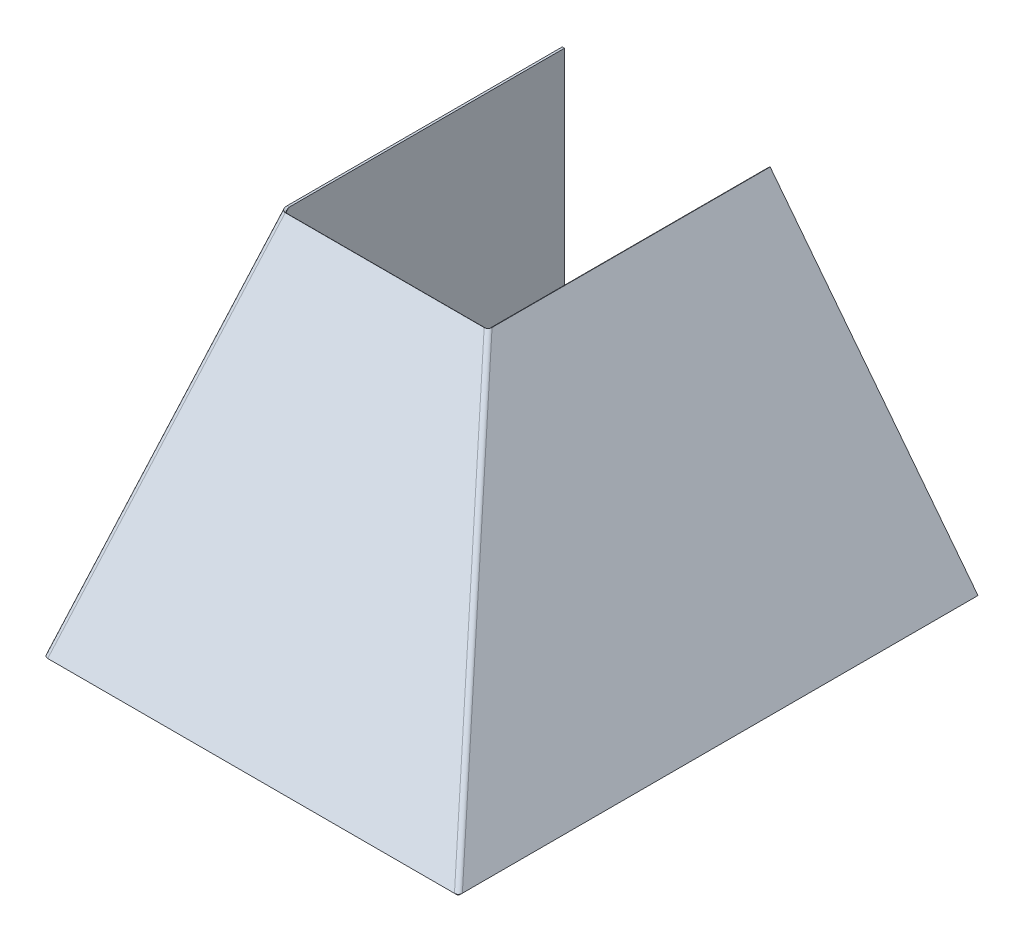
ISO-10303-21;
HEADER;
FILE_DESCRIPTION(('STEP AP214'),'2;1');
FILE_NAME('part.step','',(''),(''),'','','');
FILE_SCHEMA(('AUTOMOTIVE_DESIGN { 1 0 10303 214 1 1 1 1 }'));
ENDSEC;
DATA;
#1=APPLICATION_CONTEXT('core data for automotive mechanical design processes');
#2=APPLICATION_PROTOCOL_DEFINITION('international standard','automotive_design',2000,#1);
#3=PRODUCT_CONTEXT('',#1,'mechanical');
#4=PRODUCT('Part','Part','',(#3));
#5=PRODUCT_RELATED_PRODUCT_CATEGORY('part','',(#4));
#6=PRODUCT_DEFINITION_FORMATION('','',#4);
#7=PRODUCT_DEFINITION_CONTEXT('part definition',#1,'design');
#8=PRODUCT_DEFINITION('design','',#6,#7);
#9=PRODUCT_DEFINITION_SHAPE('','',#8);
#10=(LENGTH_UNIT() NAMED_UNIT(*) SI_UNIT(.MILLI.,.METRE.));
#11=(NAMED_UNIT(*) PLANE_ANGLE_UNIT() SI_UNIT($,.RADIAN.));
#12=(NAMED_UNIT(*) SI_UNIT($,.STERADIAN.) SOLID_ANGLE_UNIT());
#13=UNCERTAINTY_MEASURE_WITH_UNIT(LENGTH_MEASURE(1.E-05),#10,'distance_accuracy_value','');
#14=(GEOMETRIC_REPRESENTATION_CONTEXT(3) GLOBAL_UNCERTAINTY_ASSIGNED_CONTEXT((#13)) GLOBAL_UNIT_ASSIGNED_CONTEXT((#10,
#11,#12)) REPRESENTATION_CONTEXT('',''));
#15=CARTESIAN_POINT('',(0.,0.,0.));
#16=DIRECTION('',(0.,0.,1.));
#17=DIRECTION('',(1.,0.,0.));
#18=AXIS2_PLACEMENT_3D('',#15,#16,#17);
#19=CARTESIAN_POINT('',(0.,0.,0.));
#20=DIRECTION('',(0.,0.74740931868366,-0.66436383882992));
#21=DIRECTION('',(1.,0.,0.));
#22=AXIS2_PLACEMENT_3D('',#19,#20,#21);
#23=PLANE('',#22);
#24=DIRECTION('',(0.,0.66436383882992,0.74740931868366));
#25=VECTOR('',#24,1.);
#26=CARTESIAN_POINT('',(3.45000000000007,0.,0.));
#27=LINE('',#26,#25);
#28=CARTESIAN_POINT('',(3.45000000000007,-0.99654575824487,-1.12111397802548));
#29=VERTEX_POINT('',#28);
#30=CARTESIAN_POINT('',(3.45000000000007,0.,0.));
#31=VERTEX_POINT('',#30);
#32=EDGE_CURVE('E13',#29,#31,#27,.T.);
#33=ORIENTED_EDGE('',*,*,#32,.F.);
#34=DIRECTION('',(1.,0.,0.));
#35=VECTOR('',#34,1.);
#36=CARTESIAN_POINT('',(0.,-0.99654575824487,-1.12111397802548));
#37=LINE('',#36,#35);
#38=CARTESIAN_POINT('',(277.412037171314,-0.99654575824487,-1.12111397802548));
#39=VERTEX_POINT('',#38);
#40=EDGE_CURVE('E103',#29,#39,#37,.T.);
#41=ORIENTED_EDGE('',*,*,#40,.T.);
#42=DIRECTION('',(0.,0.664363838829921,0.747409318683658));
#43=VECTOR('',#42,1.);
#44=CARTESIAN_POINT('',(277.412037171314,0.,0.));
#45=LINE('',#44,#43);
#46=CARTESIAN_POINT('',(277.412037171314,0.,0.));
#47=VERTEX_POINT('',#46);
#48=EDGE_CURVE('E56',#39,#47,#45,.T.);
#49=ORIENTED_EDGE('',*,*,#48,.T.);
#50=DIRECTION('',(1.,0.,0.));
#51=VECTOR('',#50,1.);
#52=CARTESIAN_POINT('',(0.,0.,0.));
#53=LINE('',#52,#51);
#54=EDGE_CURVE('E105',#31,#47,#53,.T.);
#55=ORIENTED_EDGE('',*,*,#54,.F.);
#56=EDGE_LOOP('',(#33,#41,#49,#55));
#57=FACE_BOUND('',#56,.T.);
#58=ADVANCED_FACE('F44',(#57),#23,.F.);
#59=CARTESIAN_POINT('',(279.145225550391,0.,-0.597775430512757));
#60=CARTESIAN_POINT('',(278.932475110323,-0.381599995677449,-0.840918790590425));
#61=CARTESIAN_POINT('',(278.719724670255,-0.7631999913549,-1.08406215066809));
#62=CARTESIAN_POINT('',(278.506974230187,-1.14479998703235,-1.32720551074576));
#63=CARTESIAN_POINT('',(284.338004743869,0.,-5.14145722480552));
#64=CARTESIAN_POINT('',(283.372677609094,-0.38159999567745,-4.72609597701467));
#65=CARTESIAN_POINT('',(282.407350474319,-0.763199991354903,-4.31073472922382));
#66=CARTESIAN_POINT('',(281.442023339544,-1.14479998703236,-3.89537348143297));
#67=CARTESIAN_POINT('',(277.306208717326,0.,-13.1777955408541));
#68=CARTESIAN_POINT('',(276.766382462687,0.381599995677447,-12.2761475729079));
#69=CARTESIAN_POINT('',(276.226556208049,0.763199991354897,-11.3744996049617));
#70=CARTESIAN_POINT('',(275.68672995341,1.14479998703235,-10.4728516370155));
#71=CARTESIAN_POINT('',(272.113429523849,0.,-8.63411374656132));
#72=CARTESIAN_POINT('',(272.326179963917,0.381599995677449,-8.39097038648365));
#73=CARTESIAN_POINT('',(272.538930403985,0.7631999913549,-8.14782702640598));
#74=CARTESIAN_POINT('',(272.751680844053,1.14479998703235,-7.90468366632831));
#75=CARTESIAN_POINT('',(266.920650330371,0.,-4.09043195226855));
#76=CARTESIAN_POINT('',(267.885977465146,0.38159999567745,-4.5057932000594));
#77=CARTESIAN_POINT('',(268.851304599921,0.763199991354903,-4.92115444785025));
#78=CARTESIAN_POINT('',(269.816631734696,1.14479998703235,-5.3365156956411));
#79=CARTESIAN_POINT('',(273.952446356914,0.,3.94590636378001));
#80=CARTESIAN_POINT('',(274.492272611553,-0.381599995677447,3.04425839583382));
#81=CARTESIAN_POINT('',(275.032098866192,-0.763199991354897,2.14261042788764));
#82=CARTESIAN_POINT('',(275.571925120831,-1.14479998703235,1.24096245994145));
#83=CARTESIAN_POINT('',(279.145225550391,0.,-0.597775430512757));
#84=CARTESIAN_POINT('',(278.932475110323,-0.381599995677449,-0.840918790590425));
#85=CARTESIAN_POINT('',(278.719724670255,-0.7631999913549,-1.08406215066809));
#86=CARTESIAN_POINT('',(278.506974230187,-1.14479998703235,-1.32720551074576));
#87=(BOUNDED_SURFACE() B_SPLINE_SURFACE(3,3,((#59,#60,#61,#62),(#63,#64,#65,#66),(#67,#68,#69,
#70),(#71,#72,#73,#74),(#75,#76,#77,#78),(#79,#80,#81,#82),(#83,#84,#85,#86)),.UNSPECIFIED.,.T.,
.F.,.F.) B_SPLINE_SURFACE_WITH_KNOTS((4,3,4),(4,4),(0.,0.5,1.),(0.,1.),
.UNSPECIFIED.) GEOMETRIC_REPRESENTATION_ITEM() RATIONAL_B_SPLINE_SURFACE(((1.,1.,1.,1.),
(0.333333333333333,0.333333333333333,0.333333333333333,0.333333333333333),(0.333333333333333,
0.333333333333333,0.333333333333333,0.333333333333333),(1.,1.,1.,1.),(0.333333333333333,
0.333333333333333,0.333333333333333,0.333333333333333),(0.333333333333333,0.333333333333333,
0.333333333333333,0.333333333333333),(1.,1.,1.,1.))) REPRESENTATION_ITEM('') SURFACE());
#88=CARTESIAN_POINT('',(275.62932753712,0.,-4.61594458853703));
#89=DIRECTION('',(-0.166877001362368,-0.967356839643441,-0.190716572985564));
#90=DIRECTION('',(0.63700893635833,-0.253418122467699,0.728010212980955));
#91=AXIS2_PLACEMENT_3D('',#88,#89,#90);
#92=ELLIPSE('',#91,4.51743535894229,1.95);
#93=CARTESIAN_POINT('',(278.815971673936,-0.920910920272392,-2.73319337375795));
#94=VERTEX_POINT('',#93);
#95=EDGE_CURVE('E144',#39,#94,#92,.F.);
#96=DIRECTION('',(0.789352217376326,0.61394061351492,0.));
#97=VECTOR('',#96,1.);
#98=CARTESIAN_POINT('',(280.,0.,-2.73319337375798));
#99=LINE('',#98,#97);
#100=CARTESIAN_POINT('',(280.,0.,-2.73319337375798));
#101=VERTEX_POINT('',#100);
#102=EDGE_CURVE('E171',#94,#101,#99,.T.);
#103=CARTESIAN_POINT('',(275.62932753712,0.,-4.61594458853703));
#104=DIRECTION('',(0.,-1.,0.));
#105=DIRECTION('',(0.658504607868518,0.,0.752576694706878));
#106=AXIS2_PLACEMENT_3D('',#103,#104,#105);
#107=ELLIPSE('',#106,5.33921550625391,3.45);
#108=EDGE_CURVE('E180',#47,#101,#107,.F.);
#109=ORIENTED_EDGE('',*,*,#48,.F.);
#110=ORIENTED_EDGE('',*,*,#95,.T.);
#111=ORIENTED_EDGE('',*,*,#102,.T.);
#112=ORIENTED_EDGE('',*,*,#108,.F.);
#113=EDGE_LOOP('',(#109,#110,#111,#112));
#114=FACE_BOUND('',#113,.T.);
#115=ADVANCED_FACE('F179',(#114),#87,.F.);
#116=CARTESIAN_POINT('',(280.,0.,0.));
#117=DIRECTION('',(-0.61394061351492,0.789352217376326,0.));
#118=DIRECTION('',(0.,0.,-1.));
#119=AXIS2_PLACEMENT_3D('',#116,#117,#118);
#120=PLANE('',#119);
#121=ORIENTED_EDGE('',*,*,#102,.F.);
#122=DIRECTION('',(0.,0.,1.));
#123=VECTOR('',#122,1.);
#124=CARTESIAN_POINT('',(278.815971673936,-0.920910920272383,0.));
#125=LINE('',#124,#123);
#126=CARTESIAN_POINT('',(278.815971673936,-0.920910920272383,-350.));
#127=VERTEX_POINT('',#126);
#128=EDGE_CURVE('E235',#94,#127,#125,.F.);
#129=ORIENTED_EDGE('',*,*,#128,.T.);
#130=DIRECTION('',(0.789352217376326,0.61394061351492,0.));
#131=VECTOR('',#130,1.);
#132=CARTESIAN_POINT('',(280.,0.,-350.));
#133=LINE('',#132,#131);
#134=CARTESIAN_POINT('',(280.,0.,-350.));
#135=VERTEX_POINT('',#134);
#136=EDGE_CURVE('E168',#127,#135,#133,.T.);
#137=ORIENTED_EDGE('',*,*,#136,.T.);
#138=DIRECTION('',(0.,0.,-1.));
#139=VECTOR('',#138,1.);
#140=CARTESIAN_POINT('',(280.,0.,0.));
#141=LINE('',#140,#139);
#142=EDGE_CURVE('E199',#101,#135,#141,.T.);
#143=ORIENTED_EDGE('',*,*,#142,.F.);
#144=EDGE_LOOP('',(#121,#129,#137,#143));
#145=FACE_BOUND('',#144,.T.);
#146=ADVANCED_FACE('F200',(#145),#120,.F.);
#147=CARTESIAN_POINT('',(140.,180.,-350.));
#148=DIRECTION('',(0.,0.,-1.));
#149=DIRECTION('',(0.61394061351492,-0.789352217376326,0.));
#150=AXIS2_PLACEMENT_3D('',#147,#148,#149);
#151=PLANE('',#150);
#152=ORIENTED_EDGE('',*,*,#136,.F.);
#153=DIRECTION('',(0.61394061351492,-0.789352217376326,0.));
#154=VECTOR('',#153,1.);
#155=CARTESIAN_POINT('',(173.277510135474,134.771396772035,-350.));
#156=LINE('',#155,#154);
#157=CARTESIAN_POINT('',(138.815971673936,179.079089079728,-350.));
#158=VERTEX_POINT('',#157);
#159=EDGE_CURVE('E239',#158,#127,#156,.T.);
#160=ORIENTED_EDGE('',*,*,#159,.F.);
#161=DIRECTION('',(0.789352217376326,0.61394061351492,0.));
#162=VECTOR('',#161,1.);
#163=CARTESIAN_POINT('',(140.,180.,-350.));
#164=LINE('',#163,#162);
#165=CARTESIAN_POINT('',(140.,180.,-350.));
#166=VERTEX_POINT('',#165);
#167=EDGE_CURVE('E165',#158,#166,#164,.T.);
#168=ORIENTED_EDGE('',*,*,#167,.T.);
#169=DIRECTION('',(0.61394061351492,-0.789352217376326,0.));
#170=VECTOR('',#169,1.);
#171=CARTESIAN_POINT('',(140.,180.,-350.));
#172=LINE('',#171,#170);
#173=EDGE_CURVE('E206',#166,#135,#172,.T.);
#174=ORIENTED_EDGE('',*,*,#173,.T.);
#175=EDGE_LOOP('',(#152,#160,#168,#174));
#176=FACE_BOUND('',#175,.T.);
#177=ADVANCED_FACE('F250',(#176),#151,.T.);
#178=CARTESIAN_POINT('',(140.,180.,-160.));
#179=DIRECTION('',(-0.61394061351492,0.789352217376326,0.));
#180=DIRECTION('',(0.,0.,-1.));
#181=AXIS2_PLACEMENT_3D('',#178,#179,#180);
#182=PLANE('',#181);
#183=ORIENTED_EDGE('',*,*,#167,.F.);
#184=DIRECTION('',(0.,0.,1.));
#185=VECTOR('',#184,1.);
#186=CARTESIAN_POINT('',(138.815971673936,179.079089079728,0.));
#187=LINE('',#186,#185);
#188=CARTESIAN_POINT('',(138.815971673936,179.079089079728,-162.733193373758));
#189=VERTEX_POINT('',#188);
#190=EDGE_CURVE('E141',#189,#158,#187,.F.);
#191=ORIENTED_EDGE('',*,*,#190,.F.);
#192=DIRECTION('',(0.789352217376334,0.613940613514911,0.));
#193=VECTOR('',#192,1.);
#194=CARTESIAN_POINT('',(140.,180.,-162.733193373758));
#195=LINE('',#194,#193);
#196=CARTESIAN_POINT('',(140.,180.,-162.733193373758));
#197=VERTEX_POINT('',#196);
#198=EDGE_CURVE('E162',#189,#197,#195,.T.);
#199=ORIENTED_EDGE('',*,*,#198,.T.);
#200=DIRECTION('',(0.,0.,-1.));
#201=VECTOR('',#200,1.);
#202=CARTESIAN_POINT('',(140.,180.,-160.));
#203=LINE('',#202,#201);
#204=EDGE_CURVE('E211',#197,#166,#203,.T.);
#205=ORIENTED_EDGE('',*,*,#204,.T.);
#206=EDGE_LOOP('',(#183,#191,#199,#205));
#207=FACE_BOUND('',#206,.T.);
#208=ADVANCED_FACE('F299',(#207),#182,.T.);
#209=CARTESIAN_POINT('',(139.145225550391,180.,-160.597775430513));
#210=CARTESIAN_POINT('',(138.932475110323,179.618400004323,-160.84091879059));
#211=CARTESIAN_POINT('',(138.719724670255,179.236800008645,-161.084062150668));
#212=CARTESIAN_POINT('',(138.506974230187,178.855200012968,-161.327205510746));
#213=CARTESIAN_POINT('',(133.952446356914,180.,-156.05409363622));
#214=CARTESIAN_POINT('',(134.492272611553,179.618400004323,-156.955741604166));
#215=CARTESIAN_POINT('',(135.032098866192,179.236800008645,-157.857389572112));
#216=CARTESIAN_POINT('',(135.571925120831,178.855200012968,-158.759037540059));
#217=CARTESIAN_POINT('',(126.920650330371,180.,-164.090431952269));
#218=CARTESIAN_POINT('',(127.885977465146,180.381599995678,-164.505793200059));
#219=CARTESIAN_POINT('',(128.851304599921,180.763199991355,-164.92115444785));
#220=CARTESIAN_POINT('',(129.816631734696,181.144799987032,-165.336515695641));
#221=CARTESIAN_POINT('',(132.113429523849,180.,-168.634113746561));
#222=CARTESIAN_POINT('',(132.326179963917,180.381599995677,-168.390970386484));
#223=CARTESIAN_POINT('',(132.538930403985,180.763199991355,-168.147827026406));
#224=CARTESIAN_POINT('',(132.751680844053,181.144799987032,-167.904683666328));
#225=CARTESIAN_POINT('',(137.306208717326,180.,-173.177795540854));
#226=CARTESIAN_POINT('',(136.766382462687,180.381599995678,-172.276147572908));
#227=CARTESIAN_POINT('',(136.226556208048,180.763199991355,-171.374499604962));
#228=CARTESIAN_POINT('',(135.68672995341,181.144799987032,-170.472851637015));
#229=CARTESIAN_POINT('',(144.338004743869,180.,-165.141457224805));
#230=CARTESIAN_POINT('',(143.372677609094,179.618400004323,-164.726095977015));
#231=CARTESIAN_POINT('',(142.407350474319,179.236800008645,-164.310734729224));
#232=CARTESIAN_POINT('',(141.442023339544,178.855200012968,-163.895373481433));
#233=CARTESIAN_POINT('',(139.145225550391,180.,-160.597775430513));
#234=CARTESIAN_POINT('',(138.932475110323,179.618400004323,-160.84091879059));
#235=CARTESIAN_POINT('',(138.719724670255,179.236800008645,-161.084062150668));
#236=CARTESIAN_POINT('',(138.506974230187,178.855200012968,-161.327205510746));
#237=(BOUNDED_SURFACE() B_SPLINE_SURFACE(3,3,((#209,#210,#211,#212),(#213,#214,#215,#216),(#217,
#218,#219,#220),(#221,#222,#223,#224),(#225,#226,#227,#228),(#229,#230,#231,#232),(#233,#234,
#235,#236)),.UNSPECIFIED.,.T.,.F.,.F.) B_SPLINE_SURFACE_WITH_KNOTS((4,3,4),(4,4),(0.,0.5,1.),
(0.,1.),.UNSPECIFIED.) GEOMETRIC_REPRESENTATION_ITEM() RATIONAL_B_SPLINE_SURFACE(((1.,1.,1.,1.),
(0.333333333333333,0.333333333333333,0.333333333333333,0.333333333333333),(0.333333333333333,
0.333333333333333,0.333333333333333,0.333333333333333),(1.,1.,1.,1.),(0.333333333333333,
0.333333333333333,0.333333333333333,0.333333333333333),(0.333333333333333,0.333333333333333,
0.333333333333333,0.333333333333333),(1.,1.,1.,1.))) REPRESENTATION_ITEM('') SURFACE());
#238=CARTESIAN_POINT('',(135.62932753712,180.,-164.615944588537));
#239=DIRECTION('',(0.166877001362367,0.967356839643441,0.190716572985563));
#240=DIRECTION('',(0.637008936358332,-0.253418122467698,0.728010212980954));
#241=AXIS2_PLACEMENT_3D('',#238,#239,#240);
#242=ELLIPSE('',#241,4.5174353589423,1.95);
#243=CARTESIAN_POINT('',(137.412037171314,179.003454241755,-161.121113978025));
#244=VERTEX_POINT('',#243);
#245=EDGE_CURVE('E139',#189,#244,#242,.F.);
#246=DIRECTION('',(0.,0.66436383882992,0.74740931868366));
#247=VECTOR('',#246,1.);
#248=CARTESIAN_POINT('',(137.412037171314,180.,-160.));
#249=LINE('',#248,#247);
#250=CARTESIAN_POINT('',(137.412037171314,180.,-160.));
#251=VERTEX_POINT('',#250);
#252=EDGE_CURVE('E160',#244,#251,#249,.T.);
#253=CARTESIAN_POINT('',(135.62932753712,180.,-164.615944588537));
#254=DIRECTION('',(0.,1.,0.));
#255=DIRECTION('',(0.658504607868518,0.,0.752576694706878));
#256=AXIS2_PLACEMENT_3D('',#253,#254,#255);
#257=ELLIPSE('',#256,5.33921550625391,3.45);
#258=EDGE_CURVE('E196',#197,#251,#257,.F.);
#259=ORIENTED_EDGE('',*,*,#198,.F.);
#260=ORIENTED_EDGE('',*,*,#245,.T.);
#261=ORIENTED_EDGE('',*,*,#252,.T.);
#262=ORIENTED_EDGE('',*,*,#258,.F.);
#263=EDGE_LOOP('',(#259,#260,#261,#262));
#264=FACE_BOUND('',#263,.T.);
#265=ADVANCED_FACE('F301',(#264),#237,.F.);
#266=CARTESIAN_POINT('',(0.,180.,-160.));
#267=DIRECTION('',(0.,0.74740931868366,-0.66436383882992));
#268=DIRECTION('',(1.,0.,0.));
#269=AXIS2_PLACEMENT_3D('',#266,#267,#268);
#270=PLANE('',#269);
#271=ORIENTED_EDGE('',*,*,#252,.F.);
#272=DIRECTION('',(1.,0.,0.));
#273=VECTOR('',#272,1.);
#274=CARTESIAN_POINT('',(0.,179.003454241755,-161.121113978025));
#275=LINE('',#274,#273);
#276=CARTESIAN_POINT('',(3.45000000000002,179.003454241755,-161.121113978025));
#277=VERTEX_POINT('',#276);
#278=EDGE_CURVE('E134',#277,#244,#275,.T.);
#279=ORIENTED_EDGE('',*,*,#278,.F.);
#280=DIRECTION('',(0.,0.664363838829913,0.747409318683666));
#281=VECTOR('',#280,1.);
#282=CARTESIAN_POINT('',(3.45000000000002,180.,-160.));
#283=LINE('',#282,#281);
#284=CARTESIAN_POINT('',(3.45000000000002,180.,-160.));
#285=VERTEX_POINT('',#284);
#286=EDGE_CURVE('E157',#277,#285,#283,.T.);
#287=ORIENTED_EDGE('',*,*,#286,.T.);
#288=DIRECTION('',(1.,0.,0.));
#289=VECTOR('',#288,1.);
#290=CARTESIAN_POINT('',(0.,180.,-160.));
#291=LINE('',#290,#289);
#292=EDGE_CURVE('E205',#285,#251,#291,.T.);
#293=ORIENTED_EDGE('',*,*,#292,.T.);
#294=EDGE_LOOP('',(#271,#279,#287,#293));
#295=FACE_BOUND('',#294,.T.);
#296=ADVANCED_FACE('F304',(#295),#270,.T.);
#297=CARTESIAN_POINT('',(3.45000000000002,180.,-160.));
#298=CARTESIAN_POINT('',(3.45000000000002,179.667818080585,-160.373704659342));
#299=CARTESIAN_POINT('',(3.45000000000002,179.33563616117,-160.747409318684));
#300=CARTESIAN_POINT('',(3.45000000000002,179.003454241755,-161.121113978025));
#301=CARTESIAN_POINT('',(-3.44999999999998,180.,-160.));
#302=CARTESIAN_POINT('',(-2.44999999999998,179.667818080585,-160.373704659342));
#303=CARTESIAN_POINT('',(-1.44999999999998,179.33563616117,-160.747409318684));
#304=CARTESIAN_POINT('',(-0.449999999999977,179.003454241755,-161.121113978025));
#305=CARTESIAN_POINT('',(-3.44999999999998,180.,-169.231889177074));
#306=CARTESIAN_POINT('',(-2.44999999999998,180.332181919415,-168.858184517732));
#307=CARTESIAN_POINT('',(-1.44999999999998,180.66436383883,-168.48447985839));
#308=CARTESIAN_POINT('',(-0.449999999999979,180.996545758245,-168.110775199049));
#309=CARTESIAN_POINT('',(3.45000000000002,180.,-169.231889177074));
#310=CARTESIAN_POINT('',(3.45000000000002,180.332181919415,-168.858184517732));
#311=CARTESIAN_POINT('',(3.45000000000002,180.66436383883,-168.48447985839));
#312=CARTESIAN_POINT('',(3.45000000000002,180.996545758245,-168.110775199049));
#313=CARTESIAN_POINT('',(10.35,180.,-169.231889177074));
#314=CARTESIAN_POINT('',(9.35000000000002,180.332181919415,-168.858184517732));
#315=CARTESIAN_POINT('',(8.35000000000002,180.66436383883,-168.48447985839));
#316=CARTESIAN_POINT('',(7.35000000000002,180.996545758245,-168.110775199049));
#317=CARTESIAN_POINT('',(10.35,180.,-160.));
#318=CARTESIAN_POINT('',(9.35000000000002,179.667818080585,-160.373704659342));
#319=CARTESIAN_POINT('',(8.35000000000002,179.33563616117,-160.747409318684));
#320=CARTESIAN_POINT('',(7.35000000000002,179.003454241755,-161.121113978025));
#321=CARTESIAN_POINT('',(3.45000000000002,180.,-160.));
#322=CARTESIAN_POINT('',(3.45000000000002,179.667818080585,-160.373704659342));
#323=CARTESIAN_POINT('',(3.45000000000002,179.33563616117,-160.747409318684));
#324=CARTESIAN_POINT('',(3.45000000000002,179.003454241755,-161.121113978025));
#325=(BOUNDED_SURFACE() B_SPLINE_SURFACE(3,3,((#297,#298,#299,#300),(#301,#302,#303,#304),(#305,
#306,#307,#308),(#309,#310,#311,#312),(#313,#314,#315,#316),(#317,#318,#319,#320),(#321,#322,
#323,#324)),.UNSPECIFIED.,.T.,.F.,.F.) B_SPLINE_SURFACE_WITH_KNOTS((4,3,4),(4,4),(0.,0.5,1.),
(0.,1.),.UNSPECIFIED.) GEOMETRIC_REPRESENTATION_ITEM() RATIONAL_B_SPLINE_SURFACE(((1.,1.,1.,1.),
(0.333333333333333,0.333333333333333,0.333333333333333,0.333333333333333),(0.333333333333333,
0.333333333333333,0.333333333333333,0.333333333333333),(1.,1.,1.,1.),(0.333333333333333,
0.333333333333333,0.333333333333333,0.333333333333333),(0.333333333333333,0.333333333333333,
0.333333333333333,0.333333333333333),(1.,1.,1.,1.))) REPRESENTATION_ITEM('') SURFACE());
#326=CARTESIAN_POINT('',(3.45000000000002,180.,-164.615944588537));
#327=DIRECTION('',(0.,0.961667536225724,0.27421806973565));
#328=DIRECTION('',(0.,-0.27421806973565,0.961667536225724));
#329=AXIS2_PLACEMENT_3D('',#326,#327,#328);
#330=ELLIPSE('',#329,3.63413599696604,1.95);
#331=CARTESIAN_POINT('',(1.50000000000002,180.,-164.615944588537));
#332=VERTEX_POINT('',#331);
#333=EDGE_CURVE('E121',#277,#332,#330,.F.);
#334=DIRECTION('',(-1.,0.,0.));
#335=VECTOR('',#334,1.);
#336=CARTESIAN_POINT('',(0.,180.,-164.615944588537));
#337=LINE('',#336,#335);
#338=CARTESIAN_POINT('',(0.,180.,-164.615944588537));
#339=VERTEX_POINT('',#338);
#340=EDGE_CURVE('E154',#332,#339,#337,.T.);
#341=CARTESIAN_POINT('',(3.45000000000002,180.,-164.615944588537));
#342=DIRECTION('',(0.,1.,0.));
#343=DIRECTION('',(0.,0.,1.));
#344=AXIS2_PLACEMENT_3D('',#341,#342,#343);
#345=ELLIPSE('',#344,4.61594458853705,3.45);
#346=EDGE_CURVE('E220',#285,#339,#345,.F.);
#347=ORIENTED_EDGE('',*,*,#286,.F.);
#348=ORIENTED_EDGE('',*,*,#333,.T.);
#349=ORIENTED_EDGE('',*,*,#340,.T.);
#350=ORIENTED_EDGE('',*,*,#346,.F.);
#351=EDGE_LOOP('',(#347,#348,#349,#350));
#352=FACE_BOUND('',#351,.T.);
#353=ADVANCED_FACE('F344',(#352),#325,.F.);
#354=CARTESIAN_POINT('',(0.,180.,-350.));
#355=DIRECTION('',(0.,1.,0.));
#356=DIRECTION('',(0.,0.,1.));
#357=AXIS2_PLACEMENT_3D('',#354,#355,#356);
#358=PLANE('',#357);
#359=ORIENTED_EDGE('',*,*,#340,.F.);
#360=DIRECTION('',(0.,0.,-1.));
#361=VECTOR('',#360,1.);
#362=CARTESIAN_POINT('',(1.50000000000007,180.,0.));
#363=LINE('',#362,#361);
#364=CARTESIAN_POINT('',(1.49999999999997,180.,-350.));
#365=VERTEX_POINT('',#364);
#366=EDGE_CURVE('E230',#365,#332,#363,.F.);
#367=ORIENTED_EDGE('',*,*,#366,.F.);
#368=DIRECTION('',(-1.,0.,0.));
#369=VECTOR('',#368,1.);
#370=CARTESIAN_POINT('',(0.,180.,-350.));
#371=LINE('',#370,#369);
#372=CARTESIAN_POINT('',(0.,180.,-350.));
#373=VERTEX_POINT('',#372);
#374=EDGE_CURVE('E151',#365,#373,#371,.T.);
#375=ORIENTED_EDGE('',*,*,#374,.T.);
#376=DIRECTION('',(0.,0.,1.));
#377=VECTOR('',#376,1.);
#378=CARTESIAN_POINT('',(0.,180.,-350.));
#379=LINE('',#378,#377);
#380=EDGE_CURVE('E271',#373,#339,#379,.T.);
#381=ORIENTED_EDGE('',*,*,#380,.T.);
#382=EDGE_LOOP('',(#359,#367,#375,#381));
#383=FACE_BOUND('',#382,.T.);
#384=ADVANCED_FACE('F272',(#383),#358,.T.);
#385=CARTESIAN_POINT('',(0.,0.,-350.));
#386=DIRECTION('',(0.,0.,-1.));
#387=DIRECTION('',(0.,1.,0.));
#388=AXIS2_PLACEMENT_3D('',#385,#386,#387);
#389=PLANE('',#388);
#390=ORIENTED_EDGE('',*,*,#374,.F.);
#391=DIRECTION('',(0.,1.,0.));
#392=VECTOR('',#391,1.);
#393=CARTESIAN_POINT('',(1.49999999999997,0.,-350.));
#394=LINE('',#393,#392);
#395=CARTESIAN_POINT('',(1.49999999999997,0.,-350.));
#396=VERTEX_POINT('',#395);
#397=EDGE_CURVE('E133',#396,#365,#394,.T.);
#398=ORIENTED_EDGE('',*,*,#397,.F.);
#399=DIRECTION('',(-1.,0.,0.));
#400=VECTOR('',#399,1.);
#401=CARTESIAN_POINT('',(0.,0.,-350.));
#402=LINE('',#401,#400);
#403=CARTESIAN_POINT('',(0.,0.,-350.));
#404=VERTEX_POINT('',#403);
#405=EDGE_CURVE('E148',#396,#404,#402,.T.);
#406=ORIENTED_EDGE('',*,*,#405,.T.);
#407=DIRECTION('',(0.,1.,0.));
#408=VECTOR('',#407,1.);
#409=CARTESIAN_POINT('',(0.,0.,-350.));
#410=LINE('',#409,#408);
#411=EDGE_CURVE('E277',#404,#373,#410,.T.);
#412=ORIENTED_EDGE('',*,*,#411,.T.);
#413=EDGE_LOOP('',(#390,#398,#406,#412));
#414=FACE_BOUND('',#413,.T.);
#415=ADVANCED_FACE('F291',(#414),#389,.T.);
#416=CARTESIAN_POINT('',(0.,0.,-350.));
#417=DIRECTION('',(0.,1.,0.));
#418=DIRECTION('',(0.,0.,1.));
#419=AXIS2_PLACEMENT_3D('',#416,#417,#418);
#420=PLANE('',#419);
#421=ORIENTED_EDGE('',*,*,#405,.F.);
#422=DIRECTION('',(0.,0.,-1.));
#423=VECTOR('',#422,1.);
#424=CARTESIAN_POINT('',(1.50000000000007,0.,0.));
#425=LINE('',#424,#423);
#426=CARTESIAN_POINT('',(1.50000000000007,0.,-4.61594458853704));
#427=VERTEX_POINT('',#426);
#428=EDGE_CURVE('E126',#396,#427,#425,.F.);
#429=ORIENTED_EDGE('',*,*,#428,.T.);
#430=DIRECTION('',(-1.,0.,0.));
#431=VECTOR('',#430,1.);
#432=CARTESIAN_POINT('',(0.,0.,-4.61594458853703));
#433=LINE('',#432,#431);
#434=CARTESIAN_POINT('',(0.,0.,-4.61594458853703));
#435=VERTEX_POINT('',#434);
#436=EDGE_CURVE('E50',#427,#435,#433,.T.);
#437=ORIENTED_EDGE('',*,*,#436,.T.);
#438=DIRECTION('',(0.,0.,1.));
#439=VECTOR('',#438,1.);
#440=CARTESIAN_POINT('',(0.,0.,-350.));
#441=LINE('',#440,#439);
#442=EDGE_CURVE('E257',#404,#435,#441,.T.);
#443=ORIENTED_EDGE('',*,*,#442,.F.);
#444=EDGE_LOOP('',(#421,#429,#437,#443));
#445=FACE_BOUND('',#444,.T.);
#446=ADVANCED_FACE('F358',(#445),#420,.F.);
#447=CARTESIAN_POINT('',(3.45000000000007,0.,0.));
#448=CARTESIAN_POINT('',(3.45000000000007,-0.33218191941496,-0.373704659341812));
#449=CARTESIAN_POINT('',(3.45000000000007,-0.664363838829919,-0.747409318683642));
#450=CARTESIAN_POINT('',(3.45000000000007,-0.996545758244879,-1.12111397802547));
#451=CARTESIAN_POINT('',(10.3500000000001,0.,0.));
#452=CARTESIAN_POINT('',(9.35000000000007,-0.33218191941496,-0.373704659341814));
#453=CARTESIAN_POINT('',(8.35000000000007,-0.66436383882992,-0.747409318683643));
#454=CARTESIAN_POINT('',(7.35000000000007,-0.996545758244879,-1.12111397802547));
#455=CARTESIAN_POINT('',(10.3500000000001,0.,-9.23188917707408));
#456=CARTESIAN_POINT('',(9.35000000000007,0.33218191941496,-8.85818451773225));
#457=CARTESIAN_POINT('',(8.35000000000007,0.66436383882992,-8.48447985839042));
#458=CARTESIAN_POINT('',(7.35000000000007,0.99654575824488,-8.11077519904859));
#459=CARTESIAN_POINT('',(3.45000000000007,0.,-9.23188917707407));
#460=CARTESIAN_POINT('',(3.45000000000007,0.33218191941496,-8.85818451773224));
#461=CARTESIAN_POINT('',(3.45000000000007,0.664363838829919,-8.48447985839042));
#462=CARTESIAN_POINT('',(3.45000000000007,0.996545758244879,-8.11077519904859));
#463=CARTESIAN_POINT('',(-3.44999999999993,0.,-9.23188917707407));
#464=CARTESIAN_POINT('',(-2.44999999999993,0.33218191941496,-8.85818451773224));
#465=CARTESIAN_POINT('',(-1.44999999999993,0.664363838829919,-8.48447985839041));
#466=CARTESIAN_POINT('',(-0.449999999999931,0.996545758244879,-8.11077519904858));
#467=CARTESIAN_POINT('',(-3.44999999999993,0.,0.));
#468=CARTESIAN_POINT('',(-2.44999999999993,-0.33218191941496,-0.373704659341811));
#469=CARTESIAN_POINT('',(-1.44999999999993,-0.66436383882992,-0.74740931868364));
#470=CARTESIAN_POINT('',(-0.449999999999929,-0.996545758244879,-1.12111397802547));
#471=CARTESIAN_POINT('',(3.45000000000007,0.,0.));
#472=CARTESIAN_POINT('',(3.45000000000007,-0.33218191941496,-0.373704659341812));
#473=CARTESIAN_POINT('',(3.45000000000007,-0.664363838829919,-0.747409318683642));
#474=CARTESIAN_POINT('',(3.45000000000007,-0.996545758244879,-1.12111397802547));
#475=(BOUNDED_SURFACE() B_SPLINE_SURFACE(3,3,((#447,#448,#449,#450),(#451,#452,#453,#454),(#455,
#456,#457,#458),(#459,#460,#461,#462),(#463,#464,#465,#466),(#467,#468,#469,#470),(#471,#472,
#473,#474)),.UNSPECIFIED.,.T.,.F.,.F.) B_SPLINE_SURFACE_WITH_KNOTS((4,3,4),(4,4),(0.,0.5,1.),
(0.,1.),.UNSPECIFIED.) GEOMETRIC_REPRESENTATION_ITEM() RATIONAL_B_SPLINE_SURFACE(((1.,1.,1.,1.),
(0.333333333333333,0.333333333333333,0.333333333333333,0.333333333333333),(0.333333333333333,
0.333333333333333,0.333333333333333,0.333333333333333),(1.,1.,1.,1.),(0.333333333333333,
0.333333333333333,0.333333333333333,0.333333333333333),(0.333333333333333,0.333333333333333,
0.333333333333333,0.333333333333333),(1.,1.,1.,1.))) REPRESENTATION_ITEM('') SURFACE());
#476=CARTESIAN_POINT('',(3.45000000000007,0.,-4.61594458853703));
#477=DIRECTION('',(0.,-0.961667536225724,-0.274218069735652));
#478=DIRECTION('',(0.,-0.274218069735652,0.961667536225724));
#479=AXIS2_PLACEMENT_3D('',#476,#477,#478);
#480=ELLIPSE('',#479,3.63413599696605,1.95);
#481=EDGE_CURVE('E118',#427,#29,#480,.F.);
#482=CARTESIAN_POINT('',(3.45000000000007,0.,-4.61594458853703));
#483=DIRECTION('',(0.,-1.,0.));
#484=DIRECTION('',(0.,0.,1.));
#485=AXIS2_PLACEMENT_3D('',#482,#483,#484);
#486=ELLIPSE('',#485,4.61594458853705,3.45);
#487=EDGE_CURVE('E224',#435,#31,#486,.F.);
#488=ORIENTED_EDGE('',*,*,#481,.T.);
#489=ORIENTED_EDGE('',*,*,#32,.T.);
#490=ORIENTED_EDGE('',*,*,#487,.F.);
#491=ORIENTED_EDGE('',*,*,#436,.F.);
#492=EDGE_LOOP('',(#488,#489,#490,#491));
#493=FACE_BOUND('',#492,.T.);
#494=ADVANCED_FACE('F46',(#493),#475,.F.);
#495=CARTESIAN_POINT('',(0.,0.,0.));
#496=DIRECTION('',(1.,0.,0.));
#497=DIRECTION('',(0.,0.,-1.));
#498=AXIS2_PLACEMENT_3D('',#495,#496,#497);
#499=PLANE('',#498);
#500=ORIENTED_EDGE('',*,*,#442,.T.);
#501=DIRECTION('',(0.,-0.74740931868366,0.66436383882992));
#502=VECTOR('',#501,1.);
#503=CARTESIAN_POINT('',(0.,-2.29205524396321,-2.57856214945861));
#504=LINE('',#503,#502);
#505=EDGE_CURVE('E213',#435,#339,#504,.F.);
#506=ORIENTED_EDGE('',*,*,#505,.T.);
#507=ORIENTED_EDGE('',*,*,#380,.F.);
#508=ORIENTED_EDGE('',*,*,#411,.F.);
#509=EDGE_LOOP('',(#500,#506,#507,#508));
#510=FACE_BOUND('',#509,.T.);
#511=ADVANCED_FACE('F280',(#510),#499,.F.);
#512=CARTESIAN_POINT('',(0.,0.,0.));
#513=DIRECTION('',(0.,-0.66436383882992,-0.74740931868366));
#514=DIRECTION('',(0.,0.74740931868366,-0.66436383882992));
#515=AXIS2_PLACEMENT_3D('',#512,#513,#514);
#516=PLANE('',#515);
#517=ORIENTED_EDGE('',*,*,#54,.T.);
#518=DIRECTION('',(0.502570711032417,-0.646162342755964,0.574366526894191));
#519=VECTOR('',#518,1.);
#520=CARTESIAN_POINT('',(207.34404840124,90.0874141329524,-80.0777014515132));
#521=LINE('',#520,#519);
#522=EDGE_CURVE('E195',#47,#251,#521,.F.);
#523=ORIENTED_EDGE('',*,*,#522,.T.);
#524=ORIENTED_EDGE('',*,*,#292,.F.);
#525=DIRECTION('',(0.,-0.74740931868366,0.66436383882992));
#526=VECTOR('',#525,1.);
#527=CARTESIAN_POINT('',(3.45000000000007,0.,0.));
#528=LINE('',#527,#526);
#529=EDGE_CURVE('E217',#285,#31,#528,.T.);
#530=ORIENTED_EDGE('',*,*,#529,.T.);
#531=EDGE_LOOP('',(#517,#523,#524,#530));
#532=FACE_BOUND('',#531,.T.);
#533=ADVANCED_FACE('F305',(#532),#516,.F.);
#534=CARTESIAN_POINT('',(174.461538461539,135.692307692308,0.));
#535=DIRECTION('',(-0.789352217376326,-0.61394061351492,0.));
#536=DIRECTION('',(0.61394061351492,-0.789352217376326,0.));
#537=AXIS2_PLACEMENT_3D('',#534,#535,#536);
#538=PLANE('',#537);
#539=ORIENTED_EDGE('',*,*,#204,.F.);
#540=DIRECTION('',(0.502570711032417,-0.646162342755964,0.574366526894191));
#541=VECTOR('',#540,1.);
#542=CARTESIAN_POINT('',(210.067313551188,89.9134540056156,-82.6562636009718));
#543=LINE('',#542,#541);
#544=EDGE_CURVE('E193',#197,#101,#543,.T.);
#545=ORIENTED_EDGE('',*,*,#544,.T.);
#546=ORIENTED_EDGE('',*,*,#142,.T.);
#547=ORIENTED_EDGE('',*,*,#173,.F.);
#548=EDGE_LOOP('',(#539,#545,#546,#547));
#549=FACE_BOUND('',#548,.T.);
#550=ADVANCED_FACE('F209',(#549),#538,.F.);
#551=CARTESIAN_POINT('',(3.45000000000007,-2.29205524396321,-2.57856214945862));
#552=DIRECTION('',(0.,-0.74740931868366,0.66436383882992));
#553=DIRECTION('',(0.,-0.66436383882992,-0.74740931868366));
#554=AXIS2_PLACEMENT_3D('',#551,#552,#553);
#555=CYLINDRICAL_SURFACE('',#554,3.45);
#556=ORIENTED_EDGE('',*,*,#346,.T.);
#557=ORIENTED_EDGE('',*,*,#505,.F.);
#558=ORIENTED_EDGE('',*,*,#487,.T.);
#559=ORIENTED_EDGE('',*,*,#529,.F.);
#560=EDGE_LOOP('',(#556,#557,#558,#559));
#561=FACE_BOUND('',#560,.T.);
#562=ADVANCED_FACE('F264',(#561),#555,.T.);
#563=CARTESIAN_POINT('',(207.34404840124,87.7953588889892,-82.6562636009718));
#564=DIRECTION('',(0.502570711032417,-0.646162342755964,0.574366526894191));
#565=DIRECTION('',(0.,-0.66436383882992,-0.74740931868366));
#566=AXIS2_PLACEMENT_3D('',#563,#564,#565);
#567=CYLINDRICAL_SURFACE('',#566,3.45);
#568=ORIENTED_EDGE('',*,*,#258,.T.);
#569=ORIENTED_EDGE('',*,*,#522,.F.);
#570=ORIENTED_EDGE('',*,*,#108,.T.);
#571=ORIENTED_EDGE('',*,*,#544,.F.);
#572=EDGE_LOOP('',(#568,#569,#570,#571));
#573=FACE_BOUND('',#572,.T.);
#574=ADVANCED_FACE('F191',(#573),#567,.T.);
#575=CARTESIAN_POINT('',(1.50000000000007,0.,0.));
#576=DIRECTION('',(1.,0.,0.));
#577=DIRECTION('',(0.,0.,-1.));
#578=AXIS2_PLACEMENT_3D('',#575,#576,#577);
#579=PLANE('',#578);
#580=ORIENTED_EDGE('',*,*,#428,.F.);
#581=ORIENTED_EDGE('',*,*,#397,.T.);
#582=ORIENTED_EDGE('',*,*,#366,.T.);
#583=DIRECTION('',(0.,-0.74740931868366,0.66436383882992));
#584=VECTOR('',#583,1.);
#585=CARTESIAN_POINT('',(1.50000000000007,-2.29205524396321,-2.57856214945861));
#586=LINE('',#585,#584);
#587=EDGE_CURVE('E125',#427,#332,#586,.F.);
#588=ORIENTED_EDGE('',*,*,#587,.F.);
#589=EDGE_LOOP('',(#580,#581,#582,#588));
#590=FACE_BOUND('',#589,.T.);
#591=ADVANCED_FACE('F371',(#590),#579,.T.);
#592=CARTESIAN_POINT('',(0.,-0.99654575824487,-1.12111397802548));
#593=DIRECTION('',(0.,-0.66436383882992,-0.74740931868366));
#594=DIRECTION('',(0.,0.74740931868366,-0.66436383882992));
#595=AXIS2_PLACEMENT_3D('',#592,#593,#594);
#596=PLANE('',#595);
#597=ORIENTED_EDGE('',*,*,#40,.F.);
#598=DIRECTION('',(0.,0.74740931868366,-0.66436383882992));
#599=VECTOR('',#598,1.);
#600=CARTESIAN_POINT('',(3.45000000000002,-0.99654575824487,-1.12111397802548));
#601=LINE('',#600,#599);
#602=EDGE_CURVE('E115',#277,#29,#601,.F.);
#603=ORIENTED_EDGE('',*,*,#602,.F.);
#604=ORIENTED_EDGE('',*,*,#278,.T.);
#605=DIRECTION('',(0.502570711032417,-0.646162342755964,0.574366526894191));
#606=VECTOR('',#605,1.);
#607=CARTESIAN_POINT('',(207.34404840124,89.0908683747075,-81.1988154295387));
#608=LINE('',#607,#606);
#609=EDGE_CURVE('E131',#39,#244,#608,.F.);
#610=ORIENTED_EDGE('',*,*,#609,.F.);
#611=EDGE_LOOP('',(#597,#603,#604,#610));
#612=FACE_BOUND('',#611,.T.);
#613=ADVANCED_FACE('F129',(#612),#596,.T.);
#614=CARTESIAN_POINT('',(173.277510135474,134.771396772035,0.));
#615=DIRECTION('',(-0.789352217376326,-0.61394061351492,0.));
#616=DIRECTION('',(0.61394061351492,-0.789352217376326,0.));
#617=AXIS2_PLACEMENT_3D('',#614,#615,#616);
#618=PLANE('',#617);
#619=ORIENTED_EDGE('',*,*,#190,.T.);
#620=ORIENTED_EDGE('',*,*,#159,.T.);
#621=ORIENTED_EDGE('',*,*,#128,.F.);
#622=DIRECTION('',(0.502570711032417,-0.646162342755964,0.574366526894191));
#623=VECTOR('',#622,1.);
#624=CARTESIAN_POINT('',(208.883285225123,88.9925430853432,-82.6562636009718));
#625=LINE('',#624,#623);
#626=EDGE_CURVE('E225',#189,#94,#625,.T.);
#627=ORIENTED_EDGE('',*,*,#626,.F.);
#628=EDGE_LOOP('',(#619,#620,#621,#627));
#629=FACE_BOUND('',#628,.T.);
#630=ADVANCED_FACE('F245',(#629),#618,.T.);
#631=CARTESIAN_POINT('',(3.45000000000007,-2.29205524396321,-2.57856214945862));
#632=DIRECTION('',(0.,-0.74740931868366,0.66436383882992));
#633=DIRECTION('',(0.,-0.66436383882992,-0.74740931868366));
#634=AXIS2_PLACEMENT_3D('',#631,#632,#633);
#635=CYLINDRICAL_SURFACE('',#634,1.95);
#636=ORIENTED_EDGE('',*,*,#333,.F.);
#637=ORIENTED_EDGE('',*,*,#602,.T.);
#638=ORIENTED_EDGE('',*,*,#481,.F.);
#639=ORIENTED_EDGE('',*,*,#587,.T.);
#640=EDGE_LOOP('',(#636,#637,#638,#639));
#641=FACE_BOUND('',#640,.T.);
#642=ADVANCED_FACE('F116',(#641),#635,.F.);
#643=CARTESIAN_POINT('',(207.34404840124,87.7953588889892,-82.6562636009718));
#644=DIRECTION('',(0.502570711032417,-0.646162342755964,0.574366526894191));
#645=DIRECTION('',(0.,-0.66436383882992,-0.74740931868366));
#646=AXIS2_PLACEMENT_3D('',#643,#644,#645);
#647=CYLINDRICAL_SURFACE('',#646,1.95);
#648=ORIENTED_EDGE('',*,*,#245,.F.);
#649=ORIENTED_EDGE('',*,*,#626,.T.);
#650=ORIENTED_EDGE('',*,*,#95,.F.);
#651=ORIENTED_EDGE('',*,*,#609,.T.);
#652=EDGE_LOOP('',(#648,#649,#650,#651));
#653=FACE_BOUND('',#652,.T.);
#654=ADVANCED_FACE('F361',(#653),#647,.F.);
#655=CLOSED_SHELL('',(#58,#115,#146,#177,#208,#265,#296,#353,#384,#415,#446,#494,#511,#533,#550,
#562,#574,#591,#613,#630,#642,#654));
#656=MANIFOLD_SOLID_BREP('B2',#655);
#657=ADVANCED_BREP_SHAPE_REPRESENTATION('',(#18,#656),#14);
#658=SHAPE_DEFINITION_REPRESENTATION(#9,#657);
ENDSEC;
END-ISO-10303-21;
